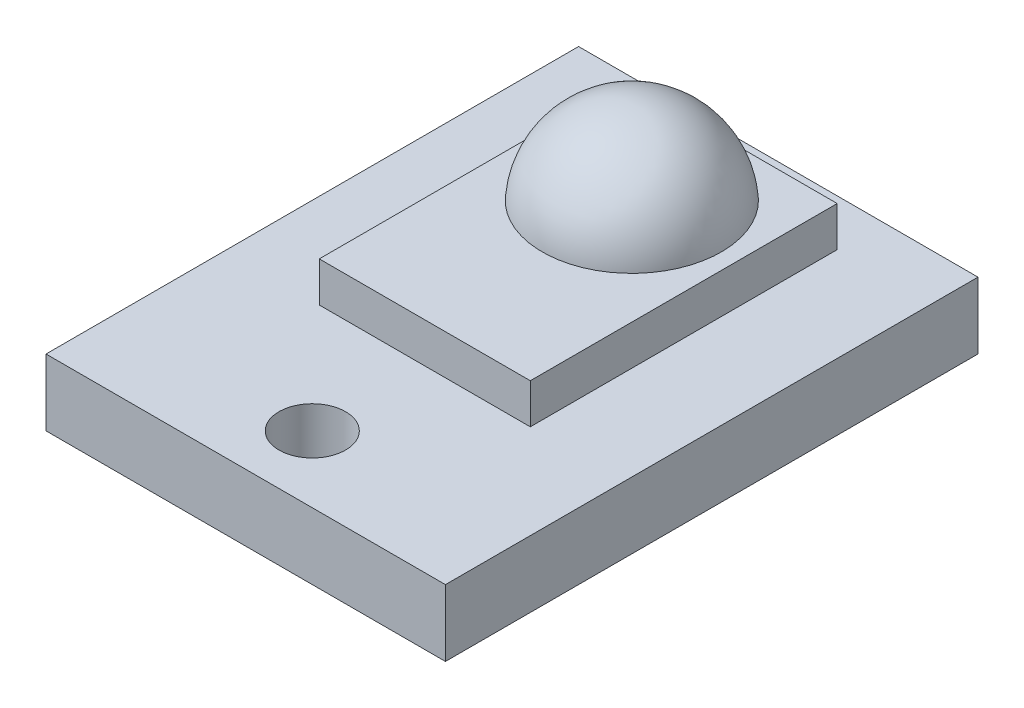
ISO-10303-21;
HEADER;
FILE_DESCRIPTION(('STEP AP214'),'2;1');
FILE_NAME('part.step','',(''),(''),'','','');
FILE_SCHEMA(('AUTOMOTIVE_DESIGN { 1 0 10303 214 1 1 1 1 }'));
ENDSEC;
DATA;
#1=APPLICATION_CONTEXT('core data for automotive mechanical design processes');
#2=APPLICATION_PROTOCOL_DEFINITION('international standard','automotive_design',2000,#1);
#3=PRODUCT_CONTEXT('',#1,'mechanical');
#4=PRODUCT('Part','Part','',(#3));
#5=PRODUCT_RELATED_PRODUCT_CATEGORY('part','',(#4));
#6=PRODUCT_DEFINITION_FORMATION('','',#4);
#7=PRODUCT_DEFINITION_CONTEXT('part definition',#1,'design');
#8=PRODUCT_DEFINITION('design','',#6,#7);
#9=PRODUCT_DEFINITION_SHAPE('','',#8);
#10=(LENGTH_UNIT() NAMED_UNIT(*) SI_UNIT(.MILLI.,.METRE.));
#11=(NAMED_UNIT(*) PLANE_ANGLE_UNIT() SI_UNIT($,.RADIAN.));
#12=(NAMED_UNIT(*) SI_UNIT($,.STERADIAN.) SOLID_ANGLE_UNIT());
#13=UNCERTAINTY_MEASURE_WITH_UNIT(LENGTH_MEASURE(1.E-05),#10,'distance_accuracy_value','');
#14=(GEOMETRIC_REPRESENTATION_CONTEXT(3) GLOBAL_UNCERTAINTY_ASSIGNED_CONTEXT((#13)) GLOBAL_UNIT_ASSIGNED_CONTEXT((#10,
#11,#12)) REPRESENTATION_CONTEXT('',''));
#15=CARTESIAN_POINT('',(0.,0.,0.));
#16=DIRECTION('',(0.,0.,1.));
#17=DIRECTION('',(1.,0.,0.));
#18=AXIS2_PLACEMENT_3D('',#15,#16,#17);
#19=CARTESIAN_POINT('',(0.,1.,0.));
#20=DIRECTION('',(0.,-1.,0.));
#21=DIRECTION('',(0.,0.,-1.));
#22=AXIS2_PLACEMENT_3D('',#19,#20,#21);
#23=PLANE('',#22);
#24=CARTESIAN_POINT('',(0.,1.,3.));
#25=DIRECTION('',(0.,1.,0.));
#26=DIRECTION('',(0.,0.,1.));
#27=AXIS2_PLACEMENT_3D('',#24,#25,#26);
#28=CIRCLE('',#27,0.5);
#29=CARTESIAN_POINT('',(0.,1.,3.5));
#30=VERTEX_POINT('',#29);
#31=EDGE_CURVE('E289',#30,#30,#28,.T.);
#32=ORIENTED_EDGE('',*,*,#31,.F.);
#33=EDGE_LOOP('',(#32));
#34=FACE_BOUND('',#33,.T.);
#35=DIRECTION('',(0.,0.,1.));
#36=VECTOR('',#35,1.);
#37=CARTESIAN_POINT('',(-3.,1.,-4.));
#38=LINE('',#37,#36);
#39=CARTESIAN_POINT('',(-3.,1.,-4.));
#40=VERTEX_POINT('',#39);
#41=CARTESIAN_POINT('',(-3.,1.,4.));
#42=VERTEX_POINT('',#41);
#43=EDGE_CURVE('E127',#40,#42,#38,.T.);
#44=ORIENTED_EDGE('',*,*,#43,.T.);
#45=DIRECTION('',(1.,0.,0.));
#46=VECTOR('',#45,1.);
#47=CARTESIAN_POINT('',(3.,1.,4.));
#48=LINE('',#47,#46);
#49=CARTESIAN_POINT('',(3.,1.,4.));
#50=VERTEX_POINT('',#49);
#51=EDGE_CURVE('E130',#42,#50,#48,.T.);
#52=ORIENTED_EDGE('',*,*,#51,.T.);
#53=DIRECTION('',(0.,0.,-1.));
#54=VECTOR('',#53,1.);
#55=CARTESIAN_POINT('',(3.,1.,-4.));
#56=LINE('',#55,#54);
#57=CARTESIAN_POINT('',(3.,1.,-4.));
#58=VERTEX_POINT('',#57);
#59=EDGE_CURVE('E133',#50,#58,#56,.T.);
#60=ORIENTED_EDGE('',*,*,#59,.T.);
#61=DIRECTION('',(-1.,0.,0.));
#62=VECTOR('',#61,1.);
#63=CARTESIAN_POINT('',(3.,1.,-4.));
#64=LINE('',#63,#62);
#65=EDGE_CURVE('E135',#58,#40,#64,.T.);
#66=ORIENTED_EDGE('',*,*,#65,.T.);
#67=EDGE_LOOP('',(#44,#52,#60,#66));
#68=FACE_BOUND('',#67,.T.);
#69=DIRECTION('',(0.,0.,-1.));
#70=VECTOR('',#69,1.);
#71=CARTESIAN_POINT('',(1.585,1.,-3.3));
#72=LINE('',#71,#70);
#73=CARTESIAN_POINT('',(1.585,1.,1.31));
#74=VERTEX_POINT('',#73);
#75=CARTESIAN_POINT('',(1.585,1.,-3.3));
#76=VERTEX_POINT('',#75);
#77=EDGE_CURVE('E117',#74,#76,#72,.T.);
#78=ORIENTED_EDGE('',*,*,#77,.F.);
#79=DIRECTION('',(1.,0.,0.));
#80=VECTOR('',#79,1.);
#81=CARTESIAN_POINT('',(1.585,1.,1.31));
#82=LINE('',#81,#80);
#83=CARTESIAN_POINT('',(-1.585,1.,1.31));
#84=VERTEX_POINT('',#83);
#85=EDGE_CURVE('E114',#84,#74,#82,.T.);
#86=ORIENTED_EDGE('',*,*,#85,.F.);
#87=DIRECTION('',(0.,0.,1.));
#88=VECTOR('',#87,1.);
#89=CARTESIAN_POINT('',(-1.585,1.,-3.3));
#90=LINE('',#89,#88);
#91=CARTESIAN_POINT('',(-1.585,1.,-3.3));
#92=VERTEX_POINT('',#91);
#93=EDGE_CURVE('E52',#92,#84,#90,.T.);
#94=ORIENTED_EDGE('',*,*,#93,.F.);
#95=DIRECTION('',(-1.,0.,0.));
#96=VECTOR('',#95,1.);
#97=CARTESIAN_POINT('',(1.585,1.,-3.3));
#98=LINE('',#97,#96);
#99=EDGE_CURVE('E47',#76,#92,#98,.T.);
#100=ORIENTED_EDGE('',*,*,#99,.F.);
#101=EDGE_LOOP('',(#78,#86,#94,#100));
#102=FACE_BOUND('',#101,.T.);
#103=ADVANCED_FACE('F32',(#34,#68,#102),#23,.F.);
#104=CARTESIAN_POINT('',(-3.,1.,-4.));
#105=DIRECTION('',(1.,0.,0.));
#106=DIRECTION('',(0.,0.,-1.));
#107=AXIS2_PLACEMENT_3D('',#104,#105,#106);
#108=PLANE('',#107);
#109=DIRECTION('',(0.,0.,1.));
#110=VECTOR('',#109,1.);
#111=CARTESIAN_POINT('',(-3.,0.,-4.));
#112=LINE('',#111,#110);
#113=CARTESIAN_POINT('',(-3.,0.,-4.));
#114=VERTEX_POINT('',#113);
#115=CARTESIAN_POINT('',(-3.,0.,4.));
#116=VERTEX_POINT('',#115);
#117=EDGE_CURVE('E121',#114,#116,#112,.T.);
#118=ORIENTED_EDGE('',*,*,#117,.T.);
#119=DIRECTION('',(0.,-1.,0.));
#120=VECTOR('',#119,1.);
#121=CARTESIAN_POINT('',(-3.,1.,4.));
#122=LINE('',#121,#120);
#123=EDGE_CURVE('E11',#42,#116,#122,.T.);
#124=ORIENTED_EDGE('',*,*,#123,.F.);
#125=ORIENTED_EDGE('',*,*,#43,.F.);
#126=DIRECTION('',(0.,-1.,0.));
#127=VECTOR('',#126,1.);
#128=CARTESIAN_POINT('',(-3.,1.,-4.));
#129=LINE('',#128,#127);
#130=EDGE_CURVE('E137',#40,#114,#129,.T.);
#131=ORIENTED_EDGE('',*,*,#130,.T.);
#132=EDGE_LOOP('',(#118,#124,#125,#131));
#133=FACE_BOUND('',#132,.T.);
#134=ADVANCED_FACE('F167',(#133),#108,.F.);
#135=CARTESIAN_POINT('',(3.,1.,4.));
#136=DIRECTION('',(0.,0.,-1.));
#137=DIRECTION('',(-1.,0.,0.));
#138=AXIS2_PLACEMENT_3D('',#135,#136,#137);
#139=PLANE('',#138);
#140=DIRECTION('',(1.,0.,0.));
#141=VECTOR('',#140,1.);
#142=CARTESIAN_POINT('',(3.,0.,4.));
#143=LINE('',#142,#141);
#144=CARTESIAN_POINT('',(3.,0.,4.));
#145=VERTEX_POINT('',#144);
#146=EDGE_CURVE('E140',#116,#145,#143,.T.);
#147=ORIENTED_EDGE('',*,*,#146,.T.);
#148=DIRECTION('',(0.,-1.,0.));
#149=VECTOR('',#148,1.);
#150=CARTESIAN_POINT('',(3.,1.,4.));
#151=LINE('',#150,#149);
#152=EDGE_CURVE('E40',#50,#145,#151,.T.);
#153=ORIENTED_EDGE('',*,*,#152,.F.);
#154=ORIENTED_EDGE('',*,*,#51,.F.);
#155=ORIENTED_EDGE('',*,*,#123,.T.);
#156=EDGE_LOOP('',(#147,#153,#154,#155));
#157=FACE_BOUND('',#156,.T.);
#158=ADVANCED_FACE('F170',(#157),#139,.F.);
#159=CARTESIAN_POINT('',(3.,1.,-4.));
#160=DIRECTION('',(-1.,0.,0.));
#161=DIRECTION('',(0.,0.,1.));
#162=AXIS2_PLACEMENT_3D('',#159,#160,#161);
#163=PLANE('',#162);
#164=DIRECTION('',(0.,0.,-1.));
#165=VECTOR('',#164,1.);
#166=CARTESIAN_POINT('',(3.,0.,-4.));
#167=LINE('',#166,#165);
#168=CARTESIAN_POINT('',(3.,0.,-4.));
#169=VERTEX_POINT('',#168);
#170=EDGE_CURVE('E142',#145,#169,#167,.T.);
#171=ORIENTED_EDGE('',*,*,#170,.T.);
#172=DIRECTION('',(0.,-1.,0.));
#173=VECTOR('',#172,1.);
#174=CARTESIAN_POINT('',(3.,1.,-4.));
#175=LINE('',#174,#173);
#176=EDGE_CURVE('E147',#58,#169,#175,.T.);
#177=ORIENTED_EDGE('',*,*,#176,.F.);
#178=ORIENTED_EDGE('',*,*,#59,.F.);
#179=ORIENTED_EDGE('',*,*,#152,.T.);
#180=EDGE_LOOP('',(#171,#177,#178,#179));
#181=FACE_BOUND('',#180,.T.);
#182=ADVANCED_FACE('F154',(#181),#163,.F.);
#183=CARTESIAN_POINT('',(3.,1.,-4.));
#184=DIRECTION('',(0.,0.,1.));
#185=DIRECTION('',(1.,0.,0.));
#186=AXIS2_PLACEMENT_3D('',#183,#184,#185);
#187=PLANE('',#186);
#188=DIRECTION('',(-1.,0.,0.));
#189=VECTOR('',#188,1.);
#190=CARTESIAN_POINT('',(3.,0.,-4.));
#191=LINE('',#190,#189);
#192=EDGE_CURVE('E131',#169,#114,#191,.T.);
#193=ORIENTED_EDGE('',*,*,#192,.T.);
#194=ORIENTED_EDGE('',*,*,#130,.F.);
#195=ORIENTED_EDGE('',*,*,#65,.F.);
#196=ORIENTED_EDGE('',*,*,#176,.T.);
#197=EDGE_LOOP('',(#193,#194,#195,#196));
#198=FACE_BOUND('',#197,.T.);
#199=ADVANCED_FACE('F163',(#198),#187,.F.);
#200=CARTESIAN_POINT('',(0.,0.,0.));
#201=DIRECTION('',(0.,-1.,0.));
#202=DIRECTION('',(0.,0.,-1.));
#203=AXIS2_PLACEMENT_3D('',#200,#201,#202);
#204=PLANE('',#203);
#205=CARTESIAN_POINT('',(0.,0.,3.));
#206=DIRECTION('',(0.,1.,0.));
#207=DIRECTION('',(0.,0.,1.));
#208=AXIS2_PLACEMENT_3D('',#205,#206,#207);
#209=CIRCLE('',#208,0.5);
#210=CARTESIAN_POINT('',(0.,0.,3.5));
#211=VERTEX_POINT('',#210);
#212=EDGE_CURVE('E287',#211,#211,#209,.T.);
#213=ORIENTED_EDGE('',*,*,#212,.T.);
#214=EDGE_LOOP('',(#213));
#215=FACE_BOUND('',#214,.T.);
#216=ORIENTED_EDGE('',*,*,#117,.F.);
#217=ORIENTED_EDGE('',*,*,#192,.F.);
#218=ORIENTED_EDGE('',*,*,#170,.F.);
#219=ORIENTED_EDGE('',*,*,#146,.F.);
#220=EDGE_LOOP('',(#216,#217,#218,#219));
#221=FACE_BOUND('',#220,.T.);
#222=ADVANCED_FACE('F160',(#215,#221),#204,.T.);
#223=CARTESIAN_POINT('',(1.585,1.6,-3.3));
#224=DIRECTION('',(-1.,0.,0.));
#225=DIRECTION('',(0.,0.,1.));
#226=AXIS2_PLACEMENT_3D('',#223,#224,#225);
#227=PLANE('',#226);
#228=ORIENTED_EDGE('',*,*,#77,.T.);
#229=DIRECTION('',(0.,-1.,0.));
#230=VECTOR('',#229,1.);
#231=CARTESIAN_POINT('',(1.585,1.6,-3.3));
#232=LINE('',#231,#230);
#233=CARTESIAN_POINT('',(1.585,1.6,-3.3));
#234=VERTEX_POINT('',#233);
#235=EDGE_CURVE('E98',#234,#76,#232,.T.);
#236=ORIENTED_EDGE('',*,*,#235,.F.);
#237=DIRECTION('',(0.,0.,-1.));
#238=VECTOR('',#237,1.);
#239=CARTESIAN_POINT('',(1.585,1.6,-3.3));
#240=LINE('',#239,#238);
#241=CARTESIAN_POINT('',(1.585,1.6,1.31));
#242=VERTEX_POINT('',#241);
#243=EDGE_CURVE('E105',#242,#234,#240,.T.);
#244=ORIENTED_EDGE('',*,*,#243,.F.);
#245=DIRECTION('',(0.,-1.,0.));
#246=VECTOR('',#245,1.);
#247=CARTESIAN_POINT('',(1.585,1.6,1.31));
#248=LINE('',#247,#246);
#249=EDGE_CURVE('E295',#242,#74,#248,.T.);
#250=ORIENTED_EDGE('',*,*,#249,.T.);
#251=EDGE_LOOP('',(#228,#236,#244,#250));
#252=FACE_BOUND('',#251,.T.);
#253=ADVANCED_FACE('F116',(#252),#227,.F.);
#254=CARTESIAN_POINT('',(1.585,1.6,-3.3));
#255=DIRECTION('',(0.,0.,1.));
#256=DIRECTION('',(1.,0.,0.));
#257=AXIS2_PLACEMENT_3D('',#254,#255,#256);
#258=PLANE('',#257);
#259=ORIENTED_EDGE('',*,*,#99,.T.);
#260=DIRECTION('',(0.,-1.,0.));
#261=VECTOR('',#260,1.);
#262=CARTESIAN_POINT('',(-1.585,1.6,-3.3));
#263=LINE('',#262,#261);
#264=CARTESIAN_POINT('',(-1.585,1.6,-3.3));
#265=VERTEX_POINT('',#264);
#266=EDGE_CURVE('E101',#265,#92,#263,.T.);
#267=ORIENTED_EDGE('',*,*,#266,.F.);
#268=DIRECTION('',(-1.,0.,0.));
#269=VECTOR('',#268,1.);
#270=CARTESIAN_POINT('',(1.585,1.6,-3.3));
#271=LINE('',#270,#269);
#272=EDGE_CURVE('E94',#234,#265,#271,.T.);
#273=ORIENTED_EDGE('',*,*,#272,.F.);
#274=ORIENTED_EDGE('',*,*,#235,.T.);
#275=EDGE_LOOP('',(#259,#267,#273,#274));
#276=FACE_BOUND('',#275,.T.);
#277=ADVANCED_FACE('F96',(#276),#258,.F.);
#278=CARTESIAN_POINT('',(-1.585,1.6,-3.3));
#279=DIRECTION('',(1.,0.,0.));
#280=DIRECTION('',(0.,0.,-1.));
#281=AXIS2_PLACEMENT_3D('',#278,#279,#280);
#282=PLANE('',#281);
#283=ORIENTED_EDGE('',*,*,#93,.T.);
#284=DIRECTION('',(0.,-1.,0.));
#285=VECTOR('',#284,1.);
#286=CARTESIAN_POINT('',(-1.585,1.6,1.31));
#287=LINE('',#286,#285);
#288=CARTESIAN_POINT('',(-1.585,1.6,1.31));
#289=VERTEX_POINT('',#288);
#290=EDGE_CURVE('E123',#289,#84,#287,.T.);
#291=ORIENTED_EDGE('',*,*,#290,.F.);
#292=DIRECTION('',(0.,0.,1.));
#293=VECTOR('',#292,1.);
#294=CARTESIAN_POINT('',(-1.585,1.6,-3.3));
#295=LINE('',#294,#293);
#296=EDGE_CURVE('E104',#265,#289,#295,.T.);
#297=ORIENTED_EDGE('',*,*,#296,.F.);
#298=ORIENTED_EDGE('',*,*,#266,.T.);
#299=EDGE_LOOP('',(#283,#291,#297,#298));
#300=FACE_BOUND('',#299,.T.);
#301=ADVANCED_FACE('F212',(#300),#282,.F.);
#302=CARTESIAN_POINT('',(1.585,1.6,1.31));
#303=DIRECTION('',(0.,0.,-1.));
#304=DIRECTION('',(-1.,0.,0.));
#305=AXIS2_PLACEMENT_3D('',#302,#303,#304);
#306=PLANE('',#305);
#307=ORIENTED_EDGE('',*,*,#85,.T.);
#308=ORIENTED_EDGE('',*,*,#249,.F.);
#309=DIRECTION('',(1.,0.,0.));
#310=VECTOR('',#309,1.);
#311=CARTESIAN_POINT('',(1.585,1.6,1.31));
#312=LINE('',#311,#310);
#313=EDGE_CURVE('E110',#289,#242,#312,.T.);
#314=ORIENTED_EDGE('',*,*,#313,.F.);
#315=ORIENTED_EDGE('',*,*,#290,.T.);
#316=EDGE_LOOP('',(#307,#308,#314,#315));
#317=FACE_BOUND('',#316,.T.);
#318=ADVANCED_FACE('F218',(#317),#306,.F.);
#319=CARTESIAN_POINT('',(0.,1.6,0.));
#320=DIRECTION('',(0.,-1.,0.));
#321=DIRECTION('',(0.,0.,-1.));
#322=AXIS2_PLACEMENT_3D('',#319,#320,#321);
#323=PLANE('',#322);
#324=CARTESIAN_POINT('',(0.,1.6,-1.8));
#325=DIRECTION('',(0.,-1.,0.));
#326=DIRECTION('',(0.,0.,-1.));
#327=AXIS2_PLACEMENT_3D('',#324,#325,#326);
#328=CIRCLE('',#327,1.34535926);
#329=CARTESIAN_POINT('',(0.,1.6,-3.14535926));
#330=VERTEX_POINT('',#329);
#331=EDGE_CURVE('E118',#330,#330,#328,.F.);
#332=ORIENTED_EDGE('',*,*,#331,.F.);
#333=EDGE_LOOP('',(#332));
#334=FACE_BOUND('',#333,.T.);
#335=ORIENTED_EDGE('',*,*,#243,.T.);
#336=ORIENTED_EDGE('',*,*,#272,.T.);
#337=ORIENTED_EDGE('',*,*,#296,.T.);
#338=ORIENTED_EDGE('',*,*,#313,.T.);
#339=EDGE_LOOP('',(#335,#336,#337,#338));
#340=FACE_BOUND('',#339,.T.);
#341=ADVANCED_FACE('F108',(#334,#340),#323,.F.);
#342=CARTESIAN_POINT('',(0.,1.5010033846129,-1.8));
#343=DIRECTION('',(0.,0.,1.));
#344=DIRECTION('',(1.,0.,0.));
#345=AXIS2_PLACEMENT_3D('',#342,#343,#344);
#346=SPHERICAL_SURFACE('',#345,1.3489966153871);
#347=CARTESIAN_POINT('',(0.,1.5010033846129,-1.8));
#348=DIRECTION('',(0.,-1.,0.));
#349=DIRECTION('',(0.,0.,-1.));
#350=AXIS2_PLACEMENT_3D('',#347,#348,#349);
#351=SPHERICAL_SURFACE('',#350,1.3489966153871);
#352=ORIENTED_EDGE('',*,*,#331,.T.);
#353=EDGE_LOOP('',(#352));
#354=FACE_BOUND('',#353,.T.);
#355=ADVANCED_FACE('F34',(#354),#351,.T.);
#356=CARTESIAN_POINT('',(0.,0.,3.));
#357=DIRECTION('',(0.,1.,0.));
#358=DIRECTION('',(0.,0.,1.));
#359=AXIS2_PLACEMENT_3D('',#356,#357,#358);
#360=CYLINDRICAL_SURFACE('',#359,0.5);
#361=ORIENTED_EDGE('',*,*,#212,.F.);
#362=EDGE_LOOP('',(#361));
#363=FACE_BOUND('',#362,.T.);
#364=ORIENTED_EDGE('',*,*,#31,.T.);
#365=EDGE_LOOP('',(#364));
#366=FACE_BOUND('',#365,.T.);
#367=ADVANCED_FACE('F239',(#363,#366),#360,.F.);
#368=CLOSED_SHELL('',(#103,#134,#158,#182,#199,#222,#253,#277,#301,#318,#341,#355,#367));
#369=MANIFOLD_SOLID_BREP('B2',#368);
#370=ADVANCED_BREP_SHAPE_REPRESENTATION('',(#18,#369),#14);
#371=SHAPE_DEFINITION_REPRESENTATION(#9,#370);
ENDSEC;
END-ISO-10303-21;
